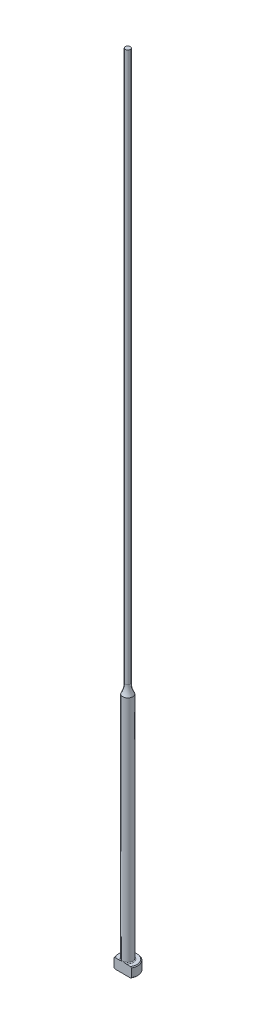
ISO-10303-21;
HEADER;
FILE_DESCRIPTION(('STEP AP214'),'2;1');
FILE_NAME('part.step','',(''),(''),'','','');
FILE_SCHEMA(('AUTOMOTIVE_DESIGN { 1 0 10303 214 1 1 1 1 }'));
ENDSEC;
DATA;
#1=APPLICATION_CONTEXT('core data for automotive mechanical design processes');
#2=APPLICATION_PROTOCOL_DEFINITION('international standard','automotive_design',2000,#1);
#3=PRODUCT_CONTEXT('',#1,'mechanical');
#4=PRODUCT('Part','Part','',(#3));
#5=PRODUCT_RELATED_PRODUCT_CATEGORY('part','',(#4));
#6=PRODUCT_DEFINITION_FORMATION('','',#4);
#7=PRODUCT_DEFINITION_CONTEXT('part definition',#1,'design');
#8=PRODUCT_DEFINITION('design','',#6,#7);
#9=PRODUCT_DEFINITION_SHAPE('','',#8);
#10=(LENGTH_UNIT() NAMED_UNIT(*) SI_UNIT(.MILLI.,.METRE.));
#11=(NAMED_UNIT(*) PLANE_ANGLE_UNIT() SI_UNIT($,.RADIAN.));
#12=(NAMED_UNIT(*) SI_UNIT($,.STERADIAN.) SOLID_ANGLE_UNIT());
#13=UNCERTAINTY_MEASURE_WITH_UNIT(LENGTH_MEASURE(1.E-05),#10,'distance_accuracy_value','');
#14=(GEOMETRIC_REPRESENTATION_CONTEXT(3) GLOBAL_UNCERTAINTY_ASSIGNED_CONTEXT((#13)) GLOBAL_UNIT_ASSIGNED_CONTEXT((#10,
#11,#12)) REPRESENTATION_CONTEXT('',''));
#15=CARTESIAN_POINT('',(0.,0.,0.));
#16=DIRECTION('',(0.,0.,1.));
#17=DIRECTION('',(1.,0.,0.));
#18=AXIS2_PLACEMENT_3D('',#15,#16,#17);
#19=CARTESIAN_POINT('',(-0.793749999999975,254.,0.));
#20=DIRECTION('',(0.,1.,0.));
#21=DIRECTION('',(0.,0.,1.));
#22=AXIS2_PLACEMENT_3D('',#19,#20,#21);
#23=PLANE('',#22);
#24=CARTESIAN_POINT('',(0.,254.,0.));
#25=DIRECTION('',(0.,1.,0.));
#26=DIRECTION('',(0.,0.,1.));
#27=AXIS2_PLACEMENT_3D('',#24,#25,#26);
#28=CIRCLE('',#27,0.793749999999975);
#29=CARTESIAN_POINT('',(0.,254.,0.793749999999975));
#30=VERTEX_POINT('',#29);
#31=EDGE_CURVE('E169',#30,#30,#28,.T.);
#32=ORIENTED_EDGE('',*,*,#31,.T.);
#33=EDGE_LOOP('',(#32));
#34=FACE_BOUND('',#33,.T.);
#35=ADVANCED_FACE('F37',(#34),#23,.T.);
#36=CARTESIAN_POINT('',(0.,259.958771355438,0.));
#37=DIRECTION('',(0.,1.,0.));
#38=DIRECTION('',(0.,0.,1.));
#39=AXIS2_PLACEMENT_3D('',#36,#37,#38);
#40=CYLINDRICAL_SURFACE('',#39,0.793749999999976);
#41=CARTESIAN_POINT('',(0.,79.2741805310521,0.));
#42=DIRECTION('',(0.,1.,0.));
#43=DIRECTION('',(0.,0.,1.));
#44=AXIS2_PLACEMENT_3D('',#41,#42,#43);
#45=CIRCLE('',#44,0.793749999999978);
#46=CARTESIAN_POINT('',(0.,79.2741805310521,0.793749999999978));
#47=VERTEX_POINT('',#46);
#48=EDGE_CURVE('E172',#47,#47,#45,.T.);
#49=ORIENTED_EDGE('',*,*,#48,.T.);
#50=EDGE_LOOP('',(#49));
#51=FACE_BOUND('',#50,.T.);
#52=ORIENTED_EDGE('',*,*,#31,.F.);
#53=EDGE_LOOP('',(#52));
#54=FACE_BOUND('',#53,.T.);
#55=ADVANCED_FACE('F160',(#51,#54),#40,.T.);
#56=CARTESIAN_POINT('',(0.,79.2741805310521,0.));
#57=DIRECTION('',(0.,1.,0.));
#58=DIRECTION('',(0.,0.,1.));
#59=AXIS2_PLACEMENT_3D('',#56,#57,#58);
#60=TOROIDAL_SURFACE('',#59,7.14374999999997,6.35);
#61=CARTESIAN_POINT('',(0.,76.2,0.));
#62=DIRECTION('',(0.,1.,0.));
#63=DIRECTION('',(0.,0.,1.));
#64=AXIS2_PLACEMENT_3D('',#61,#62,#63);
#65=CIRCLE('',#64,1.58749999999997);
#66=CARTESIAN_POINT('',(0.,76.2,1.58749999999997));
#67=VERTEX_POINT('',#66);
#68=EDGE_CURVE('E100',#67,#67,#65,.T.);
#69=ORIENTED_EDGE('',*,*,#68,.T.);
#70=EDGE_LOOP('',(#69));
#71=FACE_BOUND('',#70,.T.);
#72=ORIENTED_EDGE('',*,*,#48,.F.);
#73=EDGE_LOOP('',(#72));
#74=FACE_BOUND('',#73,.T.);
#75=ADVANCED_FACE('F165',(#71,#74),#60,.F.);
#76=CARTESIAN_POINT('',(0.,259.958771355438,0.));
#77=DIRECTION('',(0.,1.,0.));
#78=DIRECTION('',(0.,0.,1.));
#79=AXIS2_PLACEMENT_3D('',#76,#77,#78);
#80=CYLINDRICAL_SURFACE('',#79,1.58749999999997);
#81=CARTESIAN_POINT('',(0.,3.42900000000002,0.));
#82=DIRECTION('',(0.,1.,0.));
#83=DIRECTION('',(0.,0.,1.));
#84=AXIS2_PLACEMENT_3D('',#81,#82,#83);
#85=CIRCLE('',#84,1.58749999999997);
#86=CARTESIAN_POINT('',(0.,3.42900000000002,1.58749999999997));
#87=VERTEX_POINT('',#86);
#88=EDGE_CURVE('E109',#87,#87,#85,.T.);
#89=ORIENTED_EDGE('',*,*,#88,.T.);
#90=EDGE_LOOP('',(#89));
#91=FACE_BOUND('',#90,.T.);
#92=ORIENTED_EDGE('',*,*,#68,.F.);
#93=EDGE_LOOP('',(#92));
#94=FACE_BOUND('',#93,.T.);
#95=ADVANCED_FACE('F192',(#91,#94),#80,.T.);
#96=CARTESIAN_POINT('',(-3.17499999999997,3.175,0.));
#97=DIRECTION('',(0.,1.,0.));
#98=DIRECTION('',(0.,0.,1.));
#99=AXIS2_PLACEMENT_3D('',#96,#97,#98);
#100=PLANE('',#99);
#101=DIRECTION('',(-1.,0.,0.));
#102=VECTOR('',#101,1.);
#103=CARTESIAN_POINT('',(-3.17499999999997,3.175,1.58749999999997));
#104=LINE('',#103,#102);
#105=CARTESIAN_POINT('',(2.45195529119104,3.175,1.58749999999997));
#106=VERTEX_POINT('',#105);
#107=CARTESIAN_POINT('',(0.933255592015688,3.175,1.58749999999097));
#108=VERTEX_POINT('',#107);
#109=EDGE_CURVE('E58',#106,#108,#104,.T.);
#110=ORIENTED_EDGE('',*,*,#109,.F.);
#111=CARTESIAN_POINT('',(0.,3.175,0.));
#112=DIRECTION('',(0.,1.,0.));
#113=DIRECTION('',(0.,0.,1.));
#114=AXIS2_PLACEMENT_3D('',#111,#112,#113);
#115=CIRCLE('',#114,2.92099999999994);
#116=CARTESIAN_POINT('',(-2.45195529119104,3.175,1.58749999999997));
#117=VERTEX_POINT('',#116);
#118=EDGE_CURVE('E171',#106,#117,#115,.T.);
#119=ORIENTED_EDGE('',*,*,#118,.T.);
#120=CARTESIAN_POINT('',(-0.933255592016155,3.17500000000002,1.58749999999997));
#121=VERTEX_POINT('',#120);
#122=EDGE_CURVE('E140',#121,#117,#104,.T.);
#123=ORIENTED_EDGE('',*,*,#122,.F.);
#124=CARTESIAN_POINT('',(0.,3.175,0.));
#125=DIRECTION('',(0.,1.,0.));
#126=DIRECTION('',(0.,0.,1.));
#127=AXIS2_PLACEMENT_3D('',#124,#125,#126);
#128=CIRCLE('',#127,1.84149999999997);
#129=EDGE_CURVE('E113',#121,#108,#128,.F.);
#130=ORIENTED_EDGE('',*,*,#129,.T.);
#131=EDGE_LOOP('',(#110,#119,#123,#130));
#132=FACE_BOUND('',#131,.T.);
#133=ADVANCED_FACE('F189',(#132),#100,.T.);
#134=CARTESIAN_POINT('',(0.,259.958771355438,0.));
#135=DIRECTION('',(0.,1.,0.));
#136=DIRECTION('',(0.,0.,1.));
#137=AXIS2_PLACEMENT_3D('',#134,#135,#136);
#138=CYLINDRICAL_SURFACE('',#137,3.17499999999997);
#139=DIRECTION('',(0.,-1.,0.));
#140=VECTOR('',#139,1.);
#141=CARTESIAN_POINT('',(-2.74963065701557,254.,1.58749999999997));
#142=LINE('',#141,#140);
#143=CARTESIAN_POINT('',(-2.74963065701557,2.92100000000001,1.58749999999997));
#144=VERTEX_POINT('',#143);
#145=CARTESIAN_POINT('',(-2.74963065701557,0.253999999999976,1.58749999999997));
#146=VERTEX_POINT('',#145);
#147=EDGE_CURVE('E95',#144,#146,#142,.T.);
#148=ORIENTED_EDGE('',*,*,#147,.F.);
#149=CARTESIAN_POINT('',(0.,2.92100000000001,0.));
#150=DIRECTION('',(0.,1.,0.));
#151=DIRECTION('',(0.,0.,1.));
#152=AXIS2_PLACEMENT_3D('',#149,#150,#151);
#153=CIRCLE('',#152,3.17499999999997);
#154=CARTESIAN_POINT('',(2.74963065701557,2.92100000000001,1.58749999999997));
#155=VERTEX_POINT('',#154);
#156=EDGE_CURVE('E110',#144,#155,#153,.F.);
#157=ORIENTED_EDGE('',*,*,#156,.T.);
#158=DIRECTION('',(0.,-1.,0.));
#159=VECTOR('',#158,1.);
#160=CARTESIAN_POINT('',(2.74963065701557,254.,1.58749999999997));
#161=LINE('',#160,#159);
#162=CARTESIAN_POINT('',(2.74963065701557,0.253999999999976,1.58749999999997));
#163=VERTEX_POINT('',#162);
#164=EDGE_CURVE('E182',#155,#163,#161,.T.);
#165=ORIENTED_EDGE('',*,*,#164,.T.);
#166=CARTESIAN_POINT('',(0.,0.253999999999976,0.));
#167=DIRECTION('',(0.,-1.,0.));
#168=DIRECTION('',(0.,0.,-1.));
#169=AXIS2_PLACEMENT_3D('',#166,#167,#168);
#170=CIRCLE('',#169,3.17499999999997);
#171=EDGE_CURVE('E116',#163,#146,#170,.F.);
#172=ORIENTED_EDGE('',*,*,#171,.T.);
#173=EDGE_LOOP('',(#148,#157,#165,#172));
#174=FACE_BOUND('',#173,.T.);
#175=ADVANCED_FACE('F180',(#174),#138,.T.);
#176=CARTESIAN_POINT('',(0.,0.,0.));
#177=DIRECTION('',(0.,-1.,0.));
#178=DIRECTION('',(0.,0.,-1.));
#179=AXIS2_PLACEMENT_3D('',#176,#177,#178);
#180=PLANE('',#179);
#181=DIRECTION('',(1.,0.,0.));
#182=VECTOR('',#181,1.);
#183=CARTESIAN_POINT('',(-2.74963065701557,0.,1.58749999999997));
#184=LINE('',#183,#182);
#185=CARTESIAN_POINT('',(-2.45195529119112,0.,1.58749999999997));
#186=VERTEX_POINT('',#185);
#187=CARTESIAN_POINT('',(2.45195529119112,0.,1.58749999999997));
#188=VERTEX_POINT('',#187);
#189=EDGE_CURVE('E92',#186,#188,#184,.T.);
#190=ORIENTED_EDGE('',*,*,#189,.F.);
#191=CARTESIAN_POINT('',(0.,0.,0.));
#192=DIRECTION('',(0.,-1.,0.));
#193=DIRECTION('',(0.,0.,-1.));
#194=AXIS2_PLACEMENT_3D('',#191,#192,#193);
#195=CIRCLE('',#194,2.92100000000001);
#196=EDGE_CURVE('E106',#186,#188,#195,.T.);
#197=ORIENTED_EDGE('',*,*,#196,.T.);
#198=EDGE_LOOP('',(#190,#197));
#199=FACE_BOUND('',#198,.T.);
#200=ADVANCED_FACE('F105',(#199),#180,.T.);
#201=CARTESIAN_POINT('',(0.,3.17499999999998,0.));
#202=DIRECTION('',(0.,-1.,0.));
#203=DIRECTION('',(0.,0.,-1.));
#204=AXIS2_PLACEMENT_3D('',#201,#202,#203);
#205=CONICAL_SURFACE('',#204,2.92099999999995,0.785398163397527);
#206=CARTESIAN_POINT('',(2.75033065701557,2.9203937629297,1.58749999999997));
#207=CARTESIAN_POINT('',(2.66887796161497,2.99091042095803,1.58749999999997));
#208=CARTESIAN_POINT('',(2.58705989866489,3.0610138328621,1.58749999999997));
#209=CARTESIAN_POINT('',(2.42241022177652,3.20009957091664,1.58749999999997));
#210=CARTESIAN_POINT('',(2.33957813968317,3.26908134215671,1.58749999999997));
#211=CARTESIAN_POINT('',(2.17073968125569,3.40716024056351,1.58749999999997));
#212=CARTESIAN_POINT('',(2.08470440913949,3.47622217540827,1.58749999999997));
#213=CARTESIAN_POINT('',(1.91099881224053,3.61222325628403,1.58749999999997));
#214=CARTESIAN_POINT('',(1.82332890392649,3.67916293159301,1.58749999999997));
#215=CARTESIAN_POINT('',(1.64569223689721,3.8102066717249,1.58749999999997));
#216=CARTESIAN_POINT('',(1.55572245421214,3.8743066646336,1.58749999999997));
#217=CARTESIAN_POINT('',(1.37280394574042,3.99833089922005,1.58749999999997));
#218=CARTESIAN_POINT('',(1.27985285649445,4.05825170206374,1.58749999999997));
#219=CARTESIAN_POINT('',(1.09086561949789,4.17130826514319,1.58749999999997));
#220=CARTESIAN_POINT('',(0.994859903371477,4.22449421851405,1.58749999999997));
#221=CARTESIAN_POINT('',(0.798114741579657,4.32122233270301,1.58749999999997));
#222=CARTESIAN_POINT('',(0.697384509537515,4.36478238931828,1.58749999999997));
#223=CARTESIAN_POINT('',(0.541185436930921,4.41951656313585,1.58749999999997));
#224=CARTESIAN_POINT('',(0.487627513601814,4.43611950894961,1.58749999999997));
#225=CARTESIAN_POINT('',(0.379267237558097,4.46466012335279,1.58749999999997));
#226=CARTESIAN_POINT('',(0.324465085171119,4.4765985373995,1.58749999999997));
#227=CARTESIAN_POINT('',(0.214272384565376,4.49501904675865,1.58749999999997));
#228=CARTESIAN_POINT('',(0.158887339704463,4.50153345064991,1.58749999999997));
#229=CARTESIAN_POINT('',(0.047736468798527,4.5087502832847,1.58749999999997));
#230=CARTESIAN_POINT('',(-0.00802931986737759,4.50945327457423,1.58749999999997));
#231=CARTESIAN_POINT('',(-0.119372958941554,4.50499163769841,1.58749999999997));
#232=CARTESIAN_POINT('',(-0.174950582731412,4.49982147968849,1.58749999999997));
#233=CARTESIAN_POINT('',(-0.285312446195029,4.48399101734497,1.58749999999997));
#234=CARTESIAN_POINT('',(-0.340096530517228,4.4733296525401,1.58749999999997));
#235=CARTESIAN_POINT('',(-0.448865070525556,4.44711334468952,1.58749999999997));
#236=CARTESIAN_POINT('',(-0.502841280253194,4.43152477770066,1.58749999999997));
#237=CARTESIAN_POINT('',(-0.609429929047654,4.39628553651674,1.58749999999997));
#238=CARTESIAN_POINT('',(-0.662042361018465,4.37663484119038,1.58749999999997));
#239=CARTESIAN_POINT('',(-0.778129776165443,4.32902110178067,1.58749999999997));
#240=CARTESIAN_POINT('',(-0.841245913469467,4.30019026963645,1.58749999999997));
#241=CARTESIAN_POINT('',(-0.96559457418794,4.23868811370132,1.58749999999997));
#242=CARTESIAN_POINT('',(-1.02682597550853,4.20601455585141,1.58749999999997));
#243=CARTESIAN_POINT('',(-1.14774341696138,4.13769010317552,1.58749999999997));
#244=CARTESIAN_POINT('',(-1.20742632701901,4.10203371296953,1.58749999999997));
#245=CARTESIAN_POINT('',(-1.32539130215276,4.02846531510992,1.58749999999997));
#246=CARTESIAN_POINT('',(-1.38367308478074,3.99055285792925,1.58749999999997));
#247=CARTESIAN_POINT('',(-1.55734442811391,3.87382704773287,1.58749999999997));
#248=CARTESIAN_POINT('',(-1.6709584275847,3.79237897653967,1.58749999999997));
#249=CARTESIAN_POINT('',(-1.89475235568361,3.62521862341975,1.58749999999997));
#250=CARTESIAN_POINT('',(-2.00493591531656,3.53951111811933,1.58749999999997));
#251=CARTESIAN_POINT('',(-2.22248693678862,3.36554942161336,1.58749999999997));
#252=CARTESIAN_POINT('',(-2.32986450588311,3.27730782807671,1.58749999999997));
#253=CARTESIAN_POINT('',(-2.48909538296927,3.14389342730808,1.58749999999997));
#254=CARTESIAN_POINT('',(-2.54159338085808,3.09948435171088,1.58749999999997));
#255=CARTESIAN_POINT('',(-2.64622282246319,3.01024124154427,1.58749999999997));
#256=CARTESIAN_POINT('',(-2.69835428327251,2.96540722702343,1.58749999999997));
#257=CARTESIAN_POINT('',(-2.75033065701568,2.92039376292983,1.58749999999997));
#258=B_SPLINE_CURVE_WITH_KNOTS('',3,(#206,#207,#208,#209,#210,#211,#212,#213,#214,#215,#216,
#217,#218,#219,#220,#221,#222,#223,#224,#225,#226,#227,#228,#229,#230,#231,#232,#233,#234,#235,
#236,#237,#238,#239,#240,#241,#242,#243,#244,#245,#246,#247,#248,#249,#250,#251,#252,#253,#254,
#255,#256,#257),.UNSPECIFIED.,.F.,.F.,(4,2,2,2,2,2,2,2,2,2,2,2,2,2,2,2,2,2,2,2,2,2,2,2,2,4),(0.,
0.323216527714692,0.64658837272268,0.97753957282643,1.30840757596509,1.639735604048,
1.97133312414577,2.30029221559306,2.62863448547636,2.79668277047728,2.96470418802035,
3.13171746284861,3.29871457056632,3.46586904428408,3.63305581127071,3.80140905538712,
3.96976317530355,4.17775353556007,4.38586541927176,4.59436953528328,4.80291533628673,
5.22209642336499,5.64081759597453,6.0577303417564,6.26401477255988,6.47028951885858),.UNSPECIFIED.);
#259=EDGE_CURVE('E63',#155,#106,#258,.T.);
#260=ORIENTED_EDGE('',*,*,#259,.F.);
#261=ORIENTED_EDGE('',*,*,#156,.F.);
#262=EDGE_CURVE('E133',#117,#144,#258,.T.);
#263=ORIENTED_EDGE('',*,*,#262,.F.);
#264=ORIENTED_EDGE('',*,*,#118,.F.);
#265=EDGE_LOOP('',(#260,#261,#263,#264));
#266=FACE_BOUND('',#265,.T.);
#267=ADVANCED_FACE('F147',(#266),#205,.T.);
#268=CARTESIAN_POINT('',(0.,0.253999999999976,0.));
#269=DIRECTION('',(0.,1.,0.));
#270=DIRECTION('',(0.,0.,1.));
#271=AXIS2_PLACEMENT_3D('',#268,#269,#270);
#272=CONICAL_SURFACE('',#271,3.17499999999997,0.785398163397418);
#273=CARTESIAN_POINT('',(-2.75033065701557,0.254606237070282,1.58749999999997));
#274=CARTESIAN_POINT('',(-2.66887796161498,0.184089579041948,1.58749999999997));
#275=CARTESIAN_POINT('',(-2.58705989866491,0.113986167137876,1.58749999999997));
#276=CARTESIAN_POINT('',(-2.42241022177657,-0.0250995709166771,1.58749999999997));
#277=CARTESIAN_POINT('',(-2.33957813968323,-0.0940813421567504,1.58749999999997));
#278=CARTESIAN_POINT('',(-2.17073968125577,-0.232160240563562,1.58749999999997));
#279=CARTESIAN_POINT('',(-2.08470440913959,-0.301222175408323,1.58749999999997));
#280=CARTESIAN_POINT('',(-1.91099881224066,-0.437223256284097,1.58749999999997));
#281=CARTESIAN_POINT('',(-1.82332890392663,-0.50416293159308,1.58749999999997));
#282=CARTESIAN_POINT('',(-1.64569223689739,-0.635206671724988,1.58749999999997));
#283=CARTESIAN_POINT('',(-1.55572245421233,-0.699306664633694,1.58749999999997));
#284=CARTESIAN_POINT('',(-1.37280394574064,-0.823330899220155,1.58749999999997));
#285=CARTESIAN_POINT('',(-1.27985285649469,-0.883251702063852,1.58749999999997));
#286=CARTESIAN_POINT('',(-1.09086561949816,-0.996308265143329,1.58749999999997));
#287=CARTESIAN_POINT('',(-0.994859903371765,-1.0494942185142,1.58749999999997));
#288=CARTESIAN_POINT('',(-0.798114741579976,-1.14622233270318,1.58749999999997));
#289=CARTESIAN_POINT('',(-0.697384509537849,-1.18978238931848,1.58749999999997));
#290=CARTESIAN_POINT('',(-0.54118543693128,-1.24451656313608,1.58749999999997));
#291=CARTESIAN_POINT('',(-0.487627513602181,-1.26111950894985,1.58749999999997));
#292=CARTESIAN_POINT('',(-0.379267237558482,-1.28966012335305,1.58749999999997));
#293=CARTESIAN_POINT('',(-0.324465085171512,-1.30159853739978,1.58749999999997));
#294=CARTESIAN_POINT('',(-0.214272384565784,-1.32001904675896,1.58749999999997));
#295=CARTESIAN_POINT('',(-0.158887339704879,-1.32653345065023,1.58749999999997));
#296=CARTESIAN_POINT('',(-0.0477364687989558,-1.33375028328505,1.58749999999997));
#297=CARTESIAN_POINT('',(0.00802931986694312,-1.33445327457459,1.58749999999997));
#298=CARTESIAN_POINT('',(0.119372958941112,-1.32999163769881,1.58749999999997));
#299=CARTESIAN_POINT('',(0.174950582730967,-1.3248214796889,1.58749999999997));
#300=CARTESIAN_POINT('',(0.28531244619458,-1.30899101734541,1.58749999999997));
#301=CARTESIAN_POINT('',(0.340096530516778,-1.29832965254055,1.58749999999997));
#302=CARTESIAN_POINT('',(0.448865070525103,-1.27211334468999,1.58749999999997));
#303=CARTESIAN_POINT('',(0.50284128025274,-1.25652477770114,1.58749999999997));
#304=CARTESIAN_POINT('',(0.609429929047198,-1.22128553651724,1.58749999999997));
#305=CARTESIAN_POINT('',(0.662042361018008,-1.20163484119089,1.58749999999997));
#306=CARTESIAN_POINT('',(0.778129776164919,-1.15402110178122,1.58749999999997));
#307=CARTESIAN_POINT('',(0.841245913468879,-1.12519026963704,1.58749999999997));
#308=CARTESIAN_POINT('',(0.965594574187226,-1.06368811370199,1.58749999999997));
#309=CARTESIAN_POINT('',(1.02682597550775,-1.03101455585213,1.58749999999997));
#310=CARTESIAN_POINT('',(1.14774341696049,-0.962690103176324,1.58749999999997));
#311=CARTESIAN_POINT('',(1.20742632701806,-0.927033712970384,1.58749999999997));
#312=CARTESIAN_POINT('',(1.32539130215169,-0.85346531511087,1.58749999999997));
#313=CARTESIAN_POINT('',(1.38367308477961,-0.815552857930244,1.58749999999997));
#314=CARTESIAN_POINT('',(1.5573444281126,-0.698827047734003,1.58749999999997));
#315=CARTESIAN_POINT('',(1.67095842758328,-0.617378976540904,1.58749999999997));
#316=CARTESIAN_POINT('',(1.89475235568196,-0.45021862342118,1.58749999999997));
#317=CARTESIAN_POINT('',(2.0049359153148,-0.364511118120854,1.58749999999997));
#318=CARTESIAN_POINT('',(2.22248693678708,-0.19054942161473,1.58749999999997));
#319=CARTESIAN_POINT('',(2.3298645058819,-0.102307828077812,1.58749999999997));
#320=CARTESIAN_POINT('',(2.48909538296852,0.0311065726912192,1.58749999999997));
#321=CARTESIAN_POINT('',(2.54159338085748,0.0755156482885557,1.58749999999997));
#322=CARTESIAN_POINT('',(2.64622282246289,0.16475875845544,1.58749999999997));
#323=CARTESIAN_POINT('',(2.69835428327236,0.209592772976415,1.58749999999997));
#324=CARTESIAN_POINT('',(2.75033065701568,0.254606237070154,1.58749999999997));
#325=B_SPLINE_CURVE_WITH_KNOTS('',3,(#273,#274,#275,#276,#277,#278,#279,#280,#281,#282,#283,
#284,#285,#286,#287,#288,#289,#290,#291,#292,#293,#294,#295,#296,#297,#298,#299,#300,#301,#302,
#303,#304,#305,#306,#307,#308,#309,#310,#311,#312,#313,#314,#315,#316,#317,#318,#319,#320,#321,
#322,#323,#324),.UNSPECIFIED.,.F.,.F.,(4,2,2,2,2,2,2,2,2,2,2,2,2,2,2,2,2,2,2,2,2,2,2,2,2,4),(0.,
0.323216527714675,0.646588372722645,0.977539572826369,1.308407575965,1.63973560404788,
1.97133312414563,2.3002922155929,2.62863448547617,2.79668277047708,2.96470418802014,
3.13171746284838,3.29871457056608,3.46586904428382,3.63305581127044,3.80140905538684,
3.96976317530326,4.17775353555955,4.38586541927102,4.59436953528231,4.80291533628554,
5.22209642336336,5.64081759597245,6.05773034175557,6.26401477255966,6.47028951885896),.UNSPECIFIED.);
#326=EDGE_CURVE('E89',#146,#186,#325,.T.);
#327=ORIENTED_EDGE('',*,*,#326,.F.);
#328=ORIENTED_EDGE('',*,*,#171,.F.);
#329=EDGE_CURVE('E101',#188,#163,#325,.T.);
#330=ORIENTED_EDGE('',*,*,#329,.F.);
#331=ORIENTED_EDGE('',*,*,#196,.F.);
#332=EDGE_LOOP('',(#327,#328,#330,#331));
#333=FACE_BOUND('',#332,.T.);
#334=ADVANCED_FACE('F108',(#333),#272,.T.);
#335=CARTESIAN_POINT('',(0.,3.42900000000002,0.));
#336=DIRECTION('',(0.,1.,0.));
#337=DIRECTION('',(0.,0.,1.));
#338=AXIS2_PLACEMENT_3D('',#335,#336,#337);
#339=TOROIDAL_SURFACE('',#338,1.84149999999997,0.254);
#340=ORIENTED_EDGE('',*,*,#129,.F.);
#341=CARTESIAN_POINT('',(0.,3.42900000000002,1.58749999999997));
#342=CARTESIAN_POINT('',(-1.92205025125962E-10,3.42900057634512,1.58749999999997));
#343=CARTESIAN_POINT('',(-1.22611614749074E-07,3.42900115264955,1.58749999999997));
#344=CARTESIAN_POINT('',(-5.0967636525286E-07,3.42900226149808,1.58749999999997));
#345=CARTESIAN_POINT('',(-7.78176328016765E-07,3.42900279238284,1.58749999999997));
#346=CARTESIAN_POINT('',(-1.42307272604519E-06,3.42900385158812,1.58749999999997));
#347=CARTESIAN_POINT('',(-1.80713867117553E-06,3.42900437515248,1.58749999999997));
#348=CARTESIAN_POINT('',(-2.63494846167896E-06,3.4290053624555,1.58749999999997));
#349=CARTESIAN_POINT('',(-3.07814756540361E-06,3.42900582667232,1.58749999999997));
#350=CARTESIAN_POINT('',(-4.66897357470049E-06,3.4290073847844,1.58749999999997));
#351=CARTESIAN_POINT('',(-5.89404908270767E-06,3.42900840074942,1.58749999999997));
#352=CARTESIAN_POINT('',(-8.42427511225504E-06,3.42901020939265,1.58749999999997));
#353=CARTESIAN_POINT('',(-9.72480574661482E-06,3.42901100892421,1.58749999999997));
#354=CARTESIAN_POINT('',(-1.48060601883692E-05,3.42901401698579,1.58749999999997));
#355=CARTESIAN_POINT('',(-1.86838281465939E-05,3.42901606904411,1.58749999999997));
#356=CARTESIAN_POINT('',(-2.63261117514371E-05,3.42901942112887,1.58749999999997));
#357=CARTESIAN_POINT('',(-3.00687417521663E-05,3.42902077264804,1.58749999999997));
#358=CARTESIAN_POINT('',(-4.60276298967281E-05,3.42902652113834,1.58749999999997));
#359=CARTESIAN_POINT('',(-5.8247019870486E-05,3.4290308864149,1.58749999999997));
#360=CARTESIAN_POINT('',(-8.11070097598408E-05,3.42903788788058,1.58749999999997));
#361=CARTESIAN_POINT('',(-9.16953114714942E-05,3.42904068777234,1.58749999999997));
#362=CARTESIAN_POINT('',(-0.000168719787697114,3.4290628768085,1.58749999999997));
#363=CARTESIAN_POINT('',(-0.00023219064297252,3.42909118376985,1.58749999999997));
#364=CARTESIAN_POINT('',(-0.000479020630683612,3.42919723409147,1.58749999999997));
#365=CARTESIAN_POINT('',(-0.000664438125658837,3.42926834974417,1.58749999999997));
#366=CARTESIAN_POINT('',(-0.00138448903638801,3.42954862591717,1.58749999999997));
#367=CARTESIAN_POINT('',(-0.00191701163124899,3.42976473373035,1.58749999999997));
#368=CARTESIAN_POINT('',(-0.00409774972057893,3.43064550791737,1.58749999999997));
#369=CARTESIAN_POINT('',(-0.00574830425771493,3.43130231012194,1.58749999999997));
#370=CARTESIAN_POINT('',(-0.0289985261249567,3.44055947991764,1.58749999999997));
#371=CARTESIAN_POINT('',(-0.0505816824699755,3.44921674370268,1.58749999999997));
#372=CARTESIAN_POINT('',(-0.0929947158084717,3.46610702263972,1.58749999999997));
#373=CARTESIAN_POINT('',(-0.11382315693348,3.47434394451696,1.58749999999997));
#374=CARTESIAN_POINT('',(-0.1579563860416,3.49164606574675,1.58749999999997));
#375=CARTESIAN_POINT('',(-0.181267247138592,3.5006960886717,1.58749999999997));
#376=CARTESIAN_POINT('',(-0.228222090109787,3.51863224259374,1.58749999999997));
#377=CARTESIAN_POINT('',(-0.251867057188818,3.52751579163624,1.58749999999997));
#378=CARTESIAN_POINT('',(-0.310512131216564,3.54905503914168,1.58749999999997));
#379=CARTESIAN_POINT('',(-0.345588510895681,3.56150550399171,1.58749999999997));
#380=CARTESIAN_POINT('',(-0.415278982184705,3.5850302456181,1.58749999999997));
#381=CARTESIAN_POINT('',(-0.449884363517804,3.59613012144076,1.58749999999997));
#382=CARTESIAN_POINT('',(-0.524471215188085,3.61841679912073,1.58749999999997));
#383=CARTESIAN_POINT('',(-0.564517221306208,3.62939137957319,1.58749999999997));
#384=CARTESIAN_POINT('',(-0.645529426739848,3.6489746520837,1.58749999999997));
#385=CARTESIAN_POINT('',(-0.686500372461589,3.65756417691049,1.58749999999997));
#386=CARTESIAN_POINT('',(-0.771546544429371,3.67188287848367,1.58749999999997));
#387=CARTESIAN_POINT('',(-0.815658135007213,3.67740449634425,1.58749999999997));
#388=CARTESIAN_POINT('',(-0.904117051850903,3.68344603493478,1.58749999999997));
#389=CARTESIAN_POINT('',(-0.948462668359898,3.68398638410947,1.58749999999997));
#390=CARTESIAN_POINT('',(-1.02531896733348,3.67901051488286,1.58749999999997));
#391=CARTESIAN_POINT('',(-1.05792141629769,3.67502604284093,1.58749999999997));
#392=CARTESIAN_POINT('',(-1.12184393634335,3.66230832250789,1.58749999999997));
#393=CARTESIAN_POINT('',(-1.1531753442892,3.65363950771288,1.58749999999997));
#394=CARTESIAN_POINT('',(-1.19946468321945,3.6356384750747,1.58749999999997));
#395=CARTESIAN_POINT('',(-1.21526783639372,3.62848492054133,1.58749999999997));
#396=CARTESIAN_POINT('',(-1.24583726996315,3.61212937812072,1.58749999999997));
#397=CARTESIAN_POINT('',(-1.26060215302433,3.60292469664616,1.58749999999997));
#398=CARTESIAN_POINT('',(-1.28575815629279,3.58421518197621,1.58749999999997));
#399=CARTESIAN_POINT('',(-1.29644383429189,3.57510998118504,1.58749999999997));
#400=CARTESIAN_POINT('',(-1.31623154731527,3.55531539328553,1.58749999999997));
#401=CARTESIAN_POINT('',(-1.32533681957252,3.54462932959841,1.58749999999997));
#402=CARTESIAN_POINT('',(-1.33941140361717,3.52450022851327,1.58749999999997));
#403=CARTESIAN_POINT('',(-1.34484814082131,3.51538553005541,1.58749999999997));
#404=CARTESIAN_POINT('',(-1.35416329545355,3.49638544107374,1.58749999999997));
#405=CARTESIAN_POINT('',(-1.35804267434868,3.48650053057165,1.58749999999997));
#406=CARTESIAN_POINT('',(-1.36398436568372,3.46611321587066,1.58749999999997));
#407=CARTESIAN_POINT('',(-1.36603350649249,3.45560690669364,1.58749999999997));
#408=CARTESIAN_POINT('',(-1.3680840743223,3.43439627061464,1.58749999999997));
#409=CARTESIAN_POINT('',(-1.36808648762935,3.42369204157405,1.58749999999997));
#410=CARTESIAN_POINT('',(-1.36616208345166,3.40366716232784,1.58749999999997));
#411=CARTESIAN_POINT('',(-1.36444960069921,3.39432493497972,1.58749999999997));
#412=CARTESIAN_POINT('',(-1.35953338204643,3.37604480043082,1.58749999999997));
#413=CARTESIAN_POINT('',(-1.3563294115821,3.36710695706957,1.58749999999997));
#414=CARTESIAN_POINT('',(-1.34848006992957,3.34949697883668,1.58749999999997));
#415=CARTESIAN_POINT('',(-1.34378578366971,3.34084688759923,1.58749999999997));
#416=CARTESIAN_POINT('',(-1.33324445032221,3.32428742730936,1.58749999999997));
#417=CARTESIAN_POINT('',(-1.32739692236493,3.31637836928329,1.58749999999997));
#418=CARTESIAN_POINT('',(-1.31107304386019,3.29692878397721,1.58749999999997));
#419=CARTESIAN_POINT('',(-1.29989286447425,3.28597778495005,1.58749999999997));
#420=CARTESIAN_POINT('',(-1.27593566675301,3.26597490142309,1.58749999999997));
#421=CARTESIAN_POINT('',(-1.26315370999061,3.25692913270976,1.58749999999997));
#422=CARTESIAN_POINT('',(-1.22930733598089,3.23613976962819,1.58749999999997));
#423=CARTESIAN_POINT('',(-1.20751096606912,3.22559415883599,1.58749999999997));
#424=CARTESIAN_POINT('',(-1.16266144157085,3.20795356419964,1.58749999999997));
#425=CARTESIAN_POINT('',(-1.13960937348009,3.20085564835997,1.58749999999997));
#426=CARTESIAN_POINT('',(-1.07603916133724,3.18534571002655,1.58749999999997));
#427=CARTESIAN_POINT('',(-1.03486686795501,3.17965078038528,1.58749999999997));
#428=CARTESIAN_POINT('',(-0.95155815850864,3.1741711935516,1.58749999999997));
#429=CARTESIAN_POINT('',(-0.909417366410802,3.17449023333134,1.58749999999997));
#430=CARTESIAN_POINT('',(-0.811383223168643,3.18054602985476,1.58749999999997));
#431=CARTESIAN_POINT('',(-0.755610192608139,3.18806126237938,1.58749999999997));
#432=CARTESIAN_POINT('',(-0.644937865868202,3.20866626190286,1.58749999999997));
#433=CARTESIAN_POINT('',(-0.59004364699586,3.22178102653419,1.58749999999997));
#434=CARTESIAN_POINT('',(-0.485757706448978,3.25059077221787,1.58749999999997));
#435=CARTESIAN_POINT('',(-0.436281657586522,3.26598903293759,1.58749999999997));
#436=CARTESIAN_POINT('',(-0.338551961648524,3.29877502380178,1.58749999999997));
#437=CARTESIAN_POINT('',(-0.290291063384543,3.31614156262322,1.58749999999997));
#438=CARTESIAN_POINT('',(-0.225557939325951,3.34039762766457,1.58749999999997));
#439=CARTESIAN_POINT('',(-0.208874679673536,3.346735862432,1.58749999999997));
#440=CARTESIAN_POINT('',(-0.175123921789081,3.35969957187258,1.58749999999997));
#441=CARTESIAN_POINT('',(-0.158057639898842,3.36632823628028,1.58749999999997));
#442=CARTESIAN_POINT('',(-0.117638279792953,3.38214476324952,1.58749999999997));
#443=CARTESIAN_POINT('',(-0.094300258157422,3.39137029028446,1.58749999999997));
#444=CARTESIAN_POINT('',(-0.0497824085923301,3.40910304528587,1.58749999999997));
#445=CARTESIAN_POINT('',(-0.0285986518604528,3.41759960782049,1.58749999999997));
#446=CARTESIAN_POINT('',(-0.00575168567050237,3.42669635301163,1.58749999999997));
#447=CARTESIAN_POINT('',(-0.00410451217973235,3.42735181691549,1.58749999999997));
#448=CARTESIAN_POINT('',(-0.0019245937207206,3.42823223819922,1.58749999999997));
#449=CARTESIAN_POINT('',(-0.00138952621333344,3.42844937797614,1.58749999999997));
#450=CARTESIAN_POINT('',(-0.00066624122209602,3.42873091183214,1.58749999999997));
#451=CARTESIAN_POINT('',(-0.000480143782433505,3.42880228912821,1.58749999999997));
#452=CARTESIAN_POINT('',(-0.000232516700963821,3.42890868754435,1.58749999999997));
#453=CARTESIAN_POINT('',(-0.000168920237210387,3.42893705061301,1.58749999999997));
#454=CARTESIAN_POINT('',(-9.1752716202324E-05,3.42895927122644,1.58749999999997));
#455=CARTESIAN_POINT('',(-8.11550293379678E-05,3.42896207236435,1.58749999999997));
#456=CARTESIAN_POINT('',(-5.82743948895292E-05,3.42896908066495,1.58749999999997));
#457=CARTESIAN_POINT('',(-4.60440001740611E-05,3.42897345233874,1.58749999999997));
#458=CARTESIAN_POINT('',(-3.00727682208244E-05,3.42897920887,1.58749999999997));
#459=CARTESIAN_POINT('',(-2.63286807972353E-05,3.4289805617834,1.58749999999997));
#460=CARTESIAN_POINT('',(-1.86836529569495E-05,3.42898391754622,1.58749999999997));
#461=CARTESIAN_POINT('',(-1.48046517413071E-05,3.42898597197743,1.58749999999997));
#462=CARTESIAN_POINT('',(-9.72223943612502E-06,3.42898898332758,1.58749999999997));
#463=CARTESIAN_POINT('',(-8.42159649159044E-06,3.42898978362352,1.58749999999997));
#464=CARTESIAN_POINT('',(-5.89129729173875E-06,3.42899159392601,1.58749999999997));
#465=CARTESIAN_POINT('',(-4.6662686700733E-06,3.42899261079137,1.58749999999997));
#466=CARTESIAN_POINT('',(-3.07568803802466E-06,3.42899417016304,1.58749999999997));
#467=CARTESIAN_POINT('',(-2.63259565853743E-06,3.42899463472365,1.58749999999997));
#468=CARTESIAN_POINT('',(-1.80506085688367E-06,3.42899562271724,1.58749999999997));
#469=CARTESIAN_POINT('',(-1.4211638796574E-06,3.42899614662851,1.58749999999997));
#470=CARTESIAN_POINT('',(-7.76675643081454E-07,3.42899720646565,1.58749999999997));
#471=CARTESIAN_POINT('',(-5.08406487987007E-07,3.42899773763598,1.58749999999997));
#472=CARTESIAN_POINT('',(-1.21901887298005E-07,3.42899884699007,1.58749999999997));
#473=CARTESIAN_POINT('',(1.922515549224E-10,3.42899942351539,1.58749999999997));
#474=CARTESIAN_POINT('',(0.,3.42900000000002,1.58749999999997));
#475=B_SPLINE_CURVE_WITH_KNOTS('',3,(#341,#342,#343,#344,#345,#346,#347,#348,#349,#350,#351,
#352,#353,#354,#355,#356,#357,#358,#359,#360,#361,#362,#363,#364,#365,#366,#367,#368,#369,#370,
#371,#372,#373,#374,#375,#376,#377,#378,#379,#380,#381,#382,#383,#384,#385,#386,#387,#388,#389,
#390,#391,#392,#393,#394,#395,#396,#397,#398,#399,#400,#401,#402,#403,#404,#405,#406,#407,#408,
#409,#410,#411,#412,#413,#414,#415,#416,#417,#418,#419,#420,#421,#422,#423,#424,#425,#426,#427,
#428,#429,#430,#431,#432,#433,#434,#435,#436,#437,#438,#439,#440,#441,#442,#443,#444,#445,#446,
#447,#448,#449,#450,#451,#452,#453,#454,#455,#456,#457,#458,#459,#460,#461,#462,#463,#464,#465,
#466,#467,#468,#469,#470,#471,#472,#473,#474),.UNSPECIFIED.,.T.,.F.,(4,2,2,2,2,2,2,2,2,2,2,2,2,
2,2,2,2,2,2,2,2,2,2,2,2,2,2,2,2,2,2,2,2,2,2,2,2,2,2,2,2,2,2,2,2,2,2,2,2,2,2,2,2,2,2,2,2,2,2,2,2,
2,2,2,2,2,4),(0.,1.72815458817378E-06,3.5042925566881E-06,5.44431004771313E-06,
7.36755250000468E-06,1.21190896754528E-05,1.66953775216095E-05,2.98160400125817E-05,
4.17409564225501E-05,8.0660475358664E-05,0.000113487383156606,0.000321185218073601,
0.000917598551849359,0.00264089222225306,0.00797105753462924,0.0777276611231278,
0.144923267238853,0.219939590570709,0.295714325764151,0.407362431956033,0.516367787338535,
0.64087844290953,0.766362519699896,0.899536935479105,1.03216495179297,1.13045740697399,
1.22743103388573,1.27935899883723,1.33135556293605,1.37333248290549,1.41522237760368,
1.44693946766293,1.47863694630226,1.51056074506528,1.54246916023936,1.57083210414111,
1.59919951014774,1.62861579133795,1.65804436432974,1.70472658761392,1.75155645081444,
1.82378709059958,1.89595619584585,2.01995471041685,2.1460932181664,2.31447224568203,
2.48361094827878,2.63898919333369,2.79283011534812,2.84637031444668,2.90129461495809,
2.97658236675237,3.04504771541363,3.05036697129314,3.05209849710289,3.05269709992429,
3.05290520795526,3.05293806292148,3.05297701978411,3.05298895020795,3.05300207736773,
3.05300665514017,3.0530114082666,3.05301333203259,3.05301527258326,3.05301704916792,
3.05301877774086),.UNSPECIFIED.);
#476=EDGE_CURVE('E11',#121,#87,#475,.T.);
#477=ORIENTED_EDGE('',*,*,#476,.T.);
#478=ORIENTED_EDGE('',*,*,#88,.F.);
#479=CARTESIAN_POINT('',(0.,3.42900000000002,1.58749999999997));
#480=CARTESIAN_POINT('',(1.92204979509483E-10,3.42899942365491,1.58749999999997));
#481=CARTESIAN_POINT('',(1.22611614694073E-07,3.42899884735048,1.58749999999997));
#482=CARTESIAN_POINT('',(5.09676365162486E-07,3.42899773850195,1.58749999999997));
#483=CARTESIAN_POINT('',(7.78176327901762E-07,3.42899720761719,1.58749999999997));
#484=CARTESIAN_POINT('',(1.42307272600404E-06,3.42899614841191,1.58749999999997));
#485=CARTESIAN_POINT('',(1.8071386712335E-06,3.42899562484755,1.58749999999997));
#486=CARTESIAN_POINT('',(2.63494846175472E-06,3.42899463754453,1.58749999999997));
#487=CARTESIAN_POINT('',(3.07814756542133E-06,3.42899417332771,1.58749999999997));
#488=CARTESIAN_POINT('',(4.66897357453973E-06,3.42899261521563,1.58749999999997));
#489=CARTESIAN_POINT('',(5.89404908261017E-06,3.42899159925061,1.58749999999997));
#490=CARTESIAN_POINT('',(8.4242751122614E-06,3.42898979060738,1.58749999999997));
#491=CARTESIAN_POINT('',(9.72480574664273E-06,3.42898899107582,1.58749999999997));
#492=CARTESIAN_POINT('',(1.48060601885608E-05,3.42898598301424,1.58749999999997));
#493=CARTESIAN_POINT('',(1.86838281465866E-05,3.42898393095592,1.58749999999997));
#494=CARTESIAN_POINT('',(2.63261117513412E-05,3.42898057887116,1.58749999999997));
#495=CARTESIAN_POINT('',(3.00687417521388E-05,3.42897922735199,1.58749999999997));
#496=CARTESIAN_POINT('',(4.60276298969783E-05,3.42897347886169,1.58749999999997));
#497=CARTESIAN_POINT('',(5.82470198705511E-05,3.42896911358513,1.58749999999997));
#498=CARTESIAN_POINT('',(8.11070097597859E-05,3.42896211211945,1.58749999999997));
#499=CARTESIAN_POINT('',(9.16953114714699E-05,3.42895931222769,1.58749999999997));
#500=CARTESIAN_POINT('',(0.000168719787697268,3.42893712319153,1.58749999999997));
#501=CARTESIAN_POINT('',(0.000232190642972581,3.42890881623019,1.58749999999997));
#502=CARTESIAN_POINT('',(0.000479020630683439,3.42880276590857,1.58749999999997));
#503=CARTESIAN_POINT('',(0.00066443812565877,3.42873165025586,1.58749999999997));
#504=CARTESIAN_POINT('',(0.0013844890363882,3.42845137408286,1.58749999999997));
#505=CARTESIAN_POINT('',(0.00191701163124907,3.42823526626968,1.58749999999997));
#506=CARTESIAN_POINT('',(0.00409774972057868,3.42735449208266,1.58749999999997));
#507=CARTESIAN_POINT('',(0.00574830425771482,3.42669768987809,1.58749999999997));
#508=CARTESIAN_POINT('',(0.0289985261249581,3.4174405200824,1.58749999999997));
#509=CARTESIAN_POINT('',(0.0505816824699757,3.40878325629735,1.58749999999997));
#510=CARTESIAN_POINT('',(0.0929947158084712,3.39189297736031,1.58749999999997));
#511=CARTESIAN_POINT('',(0.113823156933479,3.38365605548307,1.58749999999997));
#512=CARTESIAN_POINT('',(0.1579563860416,3.36635393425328,1.58749999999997));
#513=CARTESIAN_POINT('',(0.181267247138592,3.35730391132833,1.58749999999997));
#514=CARTESIAN_POINT('',(0.228222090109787,3.33936775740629,1.58749999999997));
#515=CARTESIAN_POINT('',(0.251867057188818,3.33048420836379,1.58749999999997));
#516=CARTESIAN_POINT('',(0.310512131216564,3.30894496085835,1.58749999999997));
#517=CARTESIAN_POINT('',(0.345588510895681,3.29649449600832,1.58749999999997));
#518=CARTESIAN_POINT('',(0.415278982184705,3.27296975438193,1.58749999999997));
#519=CARTESIAN_POINT('',(0.449884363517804,3.26186987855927,1.58749999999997));
#520=CARTESIAN_POINT('',(0.524471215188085,3.2395832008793,1.58749999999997));
#521=CARTESIAN_POINT('',(0.564517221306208,3.22860862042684,1.58749999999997));
#522=CARTESIAN_POINT('',(0.645529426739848,3.20902534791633,1.58749999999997));
#523=CARTESIAN_POINT('',(0.686500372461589,3.20043582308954,1.58749999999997));
#524=CARTESIAN_POINT('',(0.771546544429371,3.18611712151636,1.58749999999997));
#525=CARTESIAN_POINT('',(0.815658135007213,3.18059550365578,1.58749999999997));
#526=CARTESIAN_POINT('',(0.904117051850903,3.17455396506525,1.58749999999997));
#527=CARTESIAN_POINT('',(0.948462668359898,3.17401361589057,1.58749999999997));
#528=CARTESIAN_POINT('',(1.02531896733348,3.17898948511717,1.58749999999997));
#529=CARTESIAN_POINT('',(1.05792141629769,3.1829739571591,1.58749999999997));
#530=CARTESIAN_POINT('',(1.12184393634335,3.19569167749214,1.58749999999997));
#531=CARTESIAN_POINT('',(1.1531753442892,3.20436049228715,1.58749999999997));
#532=CARTESIAN_POINT('',(1.19946468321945,3.22236152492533,1.58749999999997));
#533=CARTESIAN_POINT('',(1.21526783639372,3.2295150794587,1.58749999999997));
#534=CARTESIAN_POINT('',(1.24583726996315,3.24587062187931,1.58749999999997));
#535=CARTESIAN_POINT('',(1.26060215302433,3.25507530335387,1.58749999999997));
#536=CARTESIAN_POINT('',(1.28575815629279,3.27378481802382,1.58749999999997));
#537=CARTESIAN_POINT('',(1.29644383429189,3.28289001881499,1.58749999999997));
#538=CARTESIAN_POINT('',(1.31623154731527,3.30268460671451,1.58749999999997));
#539=CARTESIAN_POINT('',(1.32533681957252,3.31337067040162,1.58749999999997));
#540=CARTESIAN_POINT('',(1.33941140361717,3.33349977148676,1.58749999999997));
#541=CARTESIAN_POINT('',(1.34484814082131,3.34261446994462,1.58749999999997));
#542=CARTESIAN_POINT('',(1.35416329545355,3.36161455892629,1.58749999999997));
#543=CARTESIAN_POINT('',(1.35804267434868,3.37149946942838,1.58749999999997));
#544=CARTESIAN_POINT('',(1.36398436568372,3.39188678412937,1.58749999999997));
#545=CARTESIAN_POINT('',(1.36603350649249,3.40239309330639,1.58749999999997));
#546=CARTESIAN_POINT('',(1.3680840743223,3.42360372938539,1.58749999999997));
#547=CARTESIAN_POINT('',(1.36808648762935,3.43430795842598,1.58749999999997));
#548=CARTESIAN_POINT('',(1.36616208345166,3.45433283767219,1.58749999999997));
#549=CARTESIAN_POINT('',(1.36444960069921,3.46367506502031,1.58749999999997));
#550=CARTESIAN_POINT('',(1.35953338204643,3.48195519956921,1.58749999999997));
#551=CARTESIAN_POINT('',(1.3563294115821,3.49089304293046,1.58749999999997));
#552=CARTESIAN_POINT('',(1.34848006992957,3.50850302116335,1.58749999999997));
#553=CARTESIAN_POINT('',(1.34378578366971,3.5171531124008,1.58749999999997));
#554=CARTESIAN_POINT('',(1.33324445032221,3.53371257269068,1.58749999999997));
#555=CARTESIAN_POINT('',(1.32739692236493,3.54162163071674,1.58749999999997));
#556=CARTESIAN_POINT('',(1.31107304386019,3.56107121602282,1.58749999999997));
#557=CARTESIAN_POINT('',(1.29989286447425,3.57202221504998,1.58749999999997));
#558=CARTESIAN_POINT('',(1.27593566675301,3.59202509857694,1.58749999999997));
#559=CARTESIAN_POINT('',(1.26315370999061,3.60107086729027,1.58749999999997));
#560=CARTESIAN_POINT('',(1.22930733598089,3.62186023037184,1.58749999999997));
#561=CARTESIAN_POINT('',(1.20751096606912,3.63240584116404,1.58749999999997));
#562=CARTESIAN_POINT('',(1.16266144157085,3.65004643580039,1.58749999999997));
#563=CARTESIAN_POINT('',(1.13960937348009,3.65714435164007,1.58749999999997));
#564=CARTESIAN_POINT('',(1.07603916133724,3.67265428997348,1.58749999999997));
#565=CARTESIAN_POINT('',(1.03486686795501,3.67834921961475,1.58749999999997));
#566=CARTESIAN_POINT('',(0.95155815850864,3.68382880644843,1.58749999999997));
#567=CARTESIAN_POINT('',(0.909417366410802,3.68350976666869,1.58749999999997));
#568=CARTESIAN_POINT('',(0.811383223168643,3.67745397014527,1.58749999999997));
#569=CARTESIAN_POINT('',(0.755610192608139,3.66993873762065,1.58749999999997));
#570=CARTESIAN_POINT('',(0.644937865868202,3.64933373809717,1.58749999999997));
#571=CARTESIAN_POINT('',(0.59004364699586,3.63621897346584,1.58749999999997));
#572=CARTESIAN_POINT('',(0.485757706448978,3.60740922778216,1.58749999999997));
#573=CARTESIAN_POINT('',(0.436281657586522,3.59201096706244,1.58749999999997));
#574=CARTESIAN_POINT('',(0.338551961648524,3.55922497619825,1.58749999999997));
#575=CARTESIAN_POINT('',(0.290291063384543,3.54185843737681,1.58749999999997));
#576=CARTESIAN_POINT('',(0.225557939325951,3.51760237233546,1.58749999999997));
#577=CARTESIAN_POINT('',(0.208874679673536,3.51126413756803,1.58749999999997));
#578=CARTESIAN_POINT('',(0.17512392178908,3.49830042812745,1.58749999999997));
#579=CARTESIAN_POINT('',(0.158057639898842,3.49167176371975,1.58749999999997));
#580=CARTESIAN_POINT('',(0.117638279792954,3.47585523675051,1.58749999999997));
#581=CARTESIAN_POINT('',(0.0943002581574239,3.46662970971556,1.58749999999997));
#582=CARTESIAN_POINT('',(0.0497824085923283,3.44889695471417,1.58749999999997));
#583=CARTESIAN_POINT('',(0.0285986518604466,3.44040039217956,1.58749999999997));
#584=CARTESIAN_POINT('',(0.00575168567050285,3.4313036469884,1.58749999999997));
#585=CARTESIAN_POINT('',(0.00410451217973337,3.43064818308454,1.58749999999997));
#586=CARTESIAN_POINT('',(0.00192459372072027,3.42976776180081,1.58749999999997));
#587=CARTESIAN_POINT('',(0.00138952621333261,3.42955062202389,1.58749999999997));
#588=CARTESIAN_POINT('',(0.000666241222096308,3.42926908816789,1.58749999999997));
#589=CARTESIAN_POINT('',(0.000480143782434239,3.42919771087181,1.58749999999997));
#590=CARTESIAN_POINT('',(0.000232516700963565,3.42909131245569,1.58749999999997));
#591=CARTESIAN_POINT('',(0.000168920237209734,3.42906294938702,1.58749999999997));
#592=CARTESIAN_POINT('',(9.17527162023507E-05,3.42904072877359,1.58749999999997));
#593=CARTESIAN_POINT('',(8.11550293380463E-05,3.42903792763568,1.58749999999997));
#594=CARTESIAN_POINT('',(5.82743948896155E-05,3.42903091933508,1.58749999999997));
#595=CARTESIAN_POINT('',(4.60440001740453E-05,3.42902654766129,1.58749999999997));
#596=CARTESIAN_POINT('',(3.00727682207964E-05,3.42902079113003,1.58749999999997));
#597=CARTESIAN_POINT('',(2.63286807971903E-05,3.42901943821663,1.58749999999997));
#598=CARTESIAN_POINT('',(1.86836529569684E-05,3.42901608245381,1.58749999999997));
#599=CARTESIAN_POINT('',(1.48046517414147E-05,3.4290140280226,1.58749999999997));
#600=CARTESIAN_POINT('',(9.72223943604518E-06,3.42901101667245,1.58749999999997));
#601=CARTESIAN_POINT('',(8.42159649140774E-06,3.42901021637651,1.58749999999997));
#602=CARTESIAN_POINT('',(5.89129729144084E-06,3.42900840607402,1.58749999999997));
#603=CARTESIAN_POINT('',(4.66626866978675E-06,3.42900738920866,1.58749999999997));
#604=CARTESIAN_POINT('',(3.0756880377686E-06,3.42900582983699,1.58749999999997));
#605=CARTESIAN_POINT('',(2.63259565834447E-06,3.42900536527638,1.58749999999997));
#606=CARTESIAN_POINT('',(1.80506085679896E-06,3.42900437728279,1.58749999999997));
#607=CARTESIAN_POINT('',(1.42116387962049E-06,3.42900385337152,1.58749999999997));
#608=CARTESIAN_POINT('',(7.76675643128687E-07,3.42900279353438,1.58749999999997));
#609=CARTESIAN_POINT('',(5.08406488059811E-07,3.42900226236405,1.58749999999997));
#610=CARTESIAN_POINT('',(1.21901887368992E-07,3.42900115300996,1.58749999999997));
#611=CARTESIAN_POINT('',(-1.92251509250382E-10,3.42900057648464,1.58749999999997));
#612=CARTESIAN_POINT('',(0.,3.42900000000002,1.58749999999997));
#613=B_SPLINE_CURVE_WITH_KNOTS('',3,(#479,#480,#481,#482,#483,#484,#485,#486,#487,#488,#489,
#490,#491,#492,#493,#494,#495,#496,#497,#498,#499,#500,#501,#502,#503,#504,#505,#506,#507,#508,
#509,#510,#511,#512,#513,#514,#515,#516,#517,#518,#519,#520,#521,#522,#523,#524,#525,#526,#527,
#528,#529,#530,#531,#532,#533,#534,#535,#536,#537,#538,#539,#540,#541,#542,#543,#544,#545,#546,
#547,#548,#549,#550,#551,#552,#553,#554,#555,#556,#557,#558,#559,#560,#561,#562,#563,#564,#565,
#566,#567,#568,#569,#570,#571,#572,#573,#574,#575,#576,#577,#578,#579,#580,#581,#582,#583,#584,
#585,#586,#587,#588,#589,#590,#591,#592,#593,#594,#595,#596,#597,#598,#599,#600,#601,#602,#603,
#604,#605,#606,#607,#608,#609,#610,#611,#612),.UNSPECIFIED.,.T.,.F.,(4,2,2,2,2,2,2,2,2,2,2,2,2,
2,2,2,2,2,2,2,2,2,2,2,2,2,2,2,2,2,2,2,2,2,2,2,2,2,2,2,2,2,2,2,2,2,2,2,2,2,2,2,2,2,2,2,2,2,2,2,2,
2,2,2,2,2,4),(0.,1.72815458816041E-06,3.50429255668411E-06,5.44431004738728E-06,
7.36755249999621E-06,1.21190896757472E-05,1.66953775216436E-05,2.98160400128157E-05,
4.17409564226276E-05,8.06604753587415E-05,0.000113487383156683,0.000321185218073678,
0.000917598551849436,0.00264089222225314,0.00797105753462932,0.0777276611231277,
0.144923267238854,0.219939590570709,0.295714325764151,0.407362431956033,0.516367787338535,
0.64087844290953,0.766362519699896,0.899536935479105,1.03216495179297,1.13045740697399,
1.22743103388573,1.27935899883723,1.33135556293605,1.37333248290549,1.41522237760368,
1.44693946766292,1.47863694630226,1.51056074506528,1.54246916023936,1.57083210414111,
1.59919951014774,1.62861579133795,1.65804436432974,1.70472658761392,1.75155645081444,
1.82378709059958,1.89595619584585,2.01995471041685,2.1460932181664,2.31447224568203,
2.48361094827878,2.63898919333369,2.79283011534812,2.84637031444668,2.90129461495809,
2.97658236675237,3.04504771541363,3.05036697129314,3.05209849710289,3.05269709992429,
3.05290520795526,3.05293806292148,3.05297701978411,3.05298895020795,3.05300207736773,
3.05300665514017,3.0530114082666,3.0530133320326,3.05301527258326,3.05301704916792,
3.05301877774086),.UNSPECIFIED.);
#614=EDGE_CURVE('E51',#87,#108,#613,.T.);
#615=ORIENTED_EDGE('',*,*,#614,.T.);
#616=EDGE_LOOP('',(#340,#477,#478,#615));
#617=FACE_BOUND('',#616,.T.);
#618=ADVANCED_FACE('F39',(#617),#339,.F.);
#619=CARTESIAN_POINT('',(-2.74963065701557,254.,1.58749999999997));
#620=DIRECTION('',(0.,0.,-1.));
#621=DIRECTION('',(-1.,0.,0.));
#622=AXIS2_PLACEMENT_3D('',#619,#620,#621);
#623=PLANE('',#622);
#624=ORIENTED_EDGE('',*,*,#326,.T.);
#625=ORIENTED_EDGE('',*,*,#189,.T.);
#626=ORIENTED_EDGE('',*,*,#329,.T.);
#627=ORIENTED_EDGE('',*,*,#164,.F.);
#628=ORIENTED_EDGE('',*,*,#259,.T.);
#629=ORIENTED_EDGE('',*,*,#109,.T.);
#630=ORIENTED_EDGE('',*,*,#614,.F.);
#631=ORIENTED_EDGE('',*,*,#476,.F.);
#632=ORIENTED_EDGE('',*,*,#122,.T.);
#633=ORIENTED_EDGE('',*,*,#262,.T.);
#634=ORIENTED_EDGE('',*,*,#147,.T.);
#635=EDGE_LOOP('',(#624,#625,#626,#627,#628,#629,#630,#631,#632,#633,#634));
#636=FACE_BOUND('',#635,.T.);
#637=ADVANCED_FACE('F91',(#636),#623,.F.);
#638=CLOSED_SHELL('',(#35,#55,#75,#95,#133,#175,#200,#267,#334,#618,#637));
#639=MANIFOLD_SOLID_BREP('B2',#638);
#640=ADVANCED_BREP_SHAPE_REPRESENTATION('',(#18,#639),#14);
#641=SHAPE_DEFINITION_REPRESENTATION(#9,#640);
ENDSEC;
END-ISO-10303-21;
